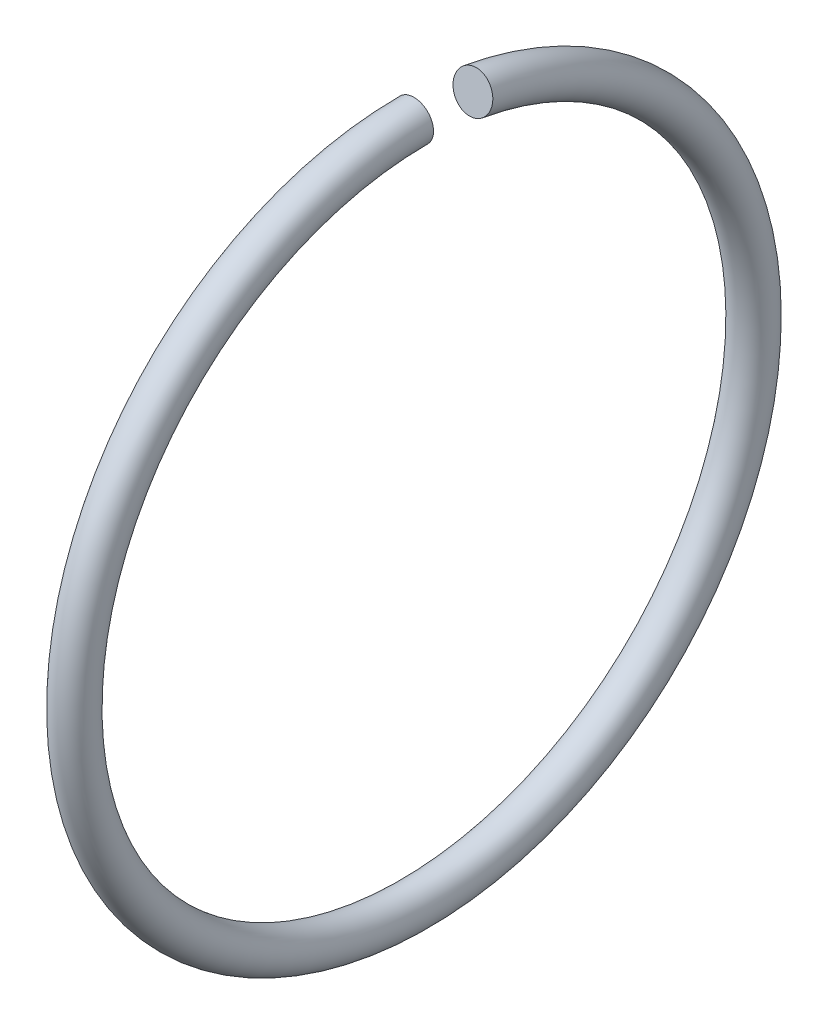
from build123d import *

# Parameters (mm, degrees)
ESQUISSE1_R           = 0.75
BASE_R_VOLUTION_ANGLE = 350


with BuildPart() as part:
    # Esquisse1 → Base-R_volution (revolve)
    with BuildSketch(Plane.XY):
        with Locations((0.75, 13)):
            Circle(ESQUISSE1_R)
    revolve(axis=Axis((-2.370983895, 0, 0), (1, 0, 0)), revolution_arc=BASE_R_VOLUTION_ANGLE)


solid = part.part
